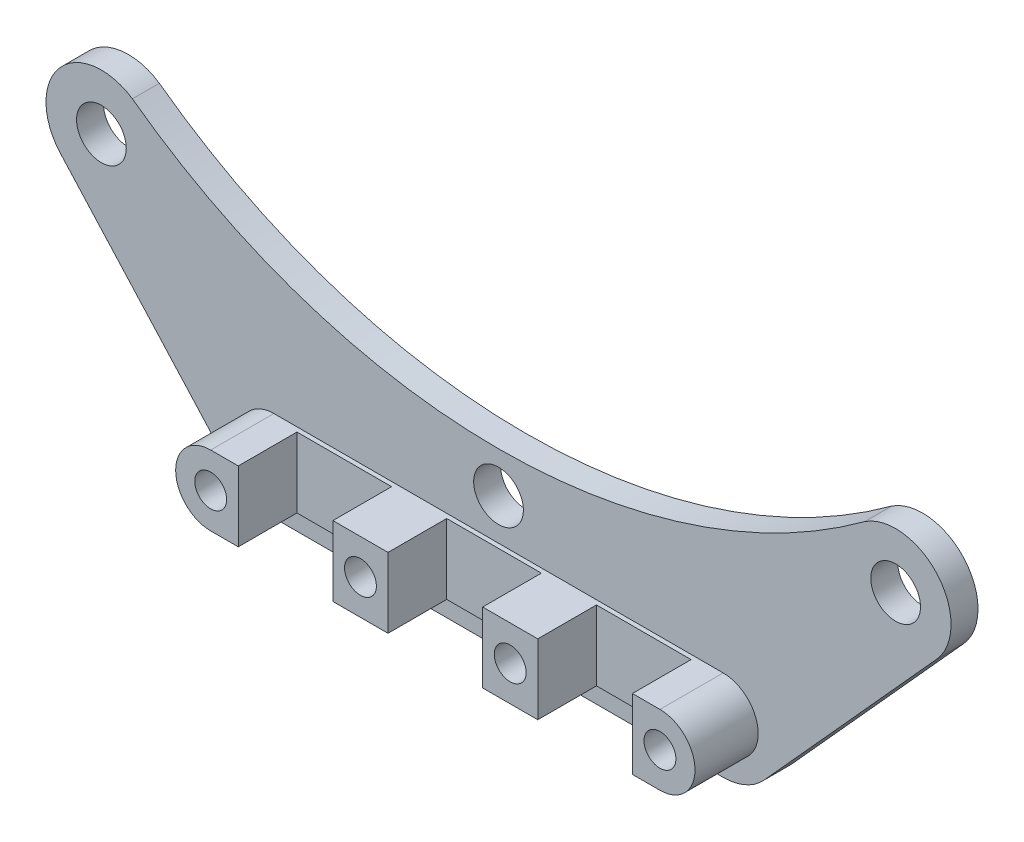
ISO-10303-21;
HEADER;
FILE_DESCRIPTION(('STEP AP214'),'2;1');
FILE_NAME('part.step','',(''),(''),'','','');
FILE_SCHEMA(('AUTOMOTIVE_DESIGN { 1 0 10303 214 1 1 1 1 }'));
ENDSEC;
DATA;
#1=APPLICATION_CONTEXT('core data for automotive mechanical design processes');
#2=APPLICATION_PROTOCOL_DEFINITION('international standard','automotive_design',2000,#1);
#3=PRODUCT_CONTEXT('',#1,'mechanical');
#4=PRODUCT('Part','Part','',(#3));
#5=PRODUCT_RELATED_PRODUCT_CATEGORY('part','',(#4));
#6=PRODUCT_DEFINITION_FORMATION('','',#4);
#7=PRODUCT_DEFINITION_CONTEXT('part definition',#1,'design');
#8=PRODUCT_DEFINITION('design','',#6,#7);
#9=PRODUCT_DEFINITION_SHAPE('','',#8);
#10=(LENGTH_UNIT() NAMED_UNIT(*) SI_UNIT(.MILLI.,.METRE.));
#11=(NAMED_UNIT(*) PLANE_ANGLE_UNIT() SI_UNIT($,.RADIAN.));
#12=(NAMED_UNIT(*) SI_UNIT($,.STERADIAN.) SOLID_ANGLE_UNIT());
#13=UNCERTAINTY_MEASURE_WITH_UNIT(LENGTH_MEASURE(1.E-05),#10,'distance_accuracy_value','');
#14=(GEOMETRIC_REPRESENTATION_CONTEXT(3) GLOBAL_UNCERTAINTY_ASSIGNED_CONTEXT((#13)) GLOBAL_UNIT_ASSIGNED_CONTEXT((#10,
#11,#12)) REPRESENTATION_CONTEXT('',''));
#15=CARTESIAN_POINT('',(0.,0.,0.));
#16=DIRECTION('',(0.,0.,1.));
#17=DIRECTION('',(1.,0.,0.));
#18=AXIS2_PLACEMENT_3D('',#15,#16,#17);
#19=CARTESIAN_POINT('',(0.,0.,7.6454));
#20=DIRECTION('',(0.,0.,1.));
#21=DIRECTION('',(1.,0.,0.));
#22=AXIS2_PLACEMENT_3D('',#19,#20,#21);
#23=PLANE('',#22);
#24=DIRECTION('',(0.,-1.,0.));
#25=VECTOR('',#24,1.);
#26=CARTESIAN_POINT('',(251.174680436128,0.,7.6454));
#27=LINE('',#26,#25);
#28=CARTESIAN_POINT('',(251.174680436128,54.27368514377,7.6454));
#29=VERTEX_POINT('',#28);
#30=CARTESIAN_POINT('',(251.174680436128,48.33008514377,7.6454));
#31=VERTEX_POINT('',#30);
#32=EDGE_CURVE('E216',#29,#31,#27,.T.);
#33=ORIENTED_EDGE('',*,*,#32,.F.);
#34=DIRECTION('',(1.,0.,0.));
#35=VECTOR('',#34,1.);
#36=CARTESIAN_POINT('',(0.,54.27368514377,7.6454));
#37=LINE('',#36,#35);
#38=CARTESIAN_POINT('',(246.501080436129,54.27368514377,7.6454));
#39=VERTEX_POINT('',#38);
#40=EDGE_CURVE('E802',#39,#29,#37,.T.);
#41=ORIENTED_EDGE('',*,*,#40,.F.);
#42=DIRECTION('',(0.,1.,0.));
#43=VECTOR('',#42,1.);
#44=CARTESIAN_POINT('',(246.501080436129,0.,7.6454));
#45=LINE('',#44,#43);
#46=CARTESIAN_POINT('',(246.501080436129,48.33008514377,7.6454));
#47=VERTEX_POINT('',#46);
#48=EDGE_CURVE('E240',#47,#39,#45,.T.);
#49=ORIENTED_EDGE('',*,*,#48,.F.);
#50=DIRECTION('',(-1.,0.,0.));
#51=VECTOR('',#50,1.);
#52=CARTESIAN_POINT('',(0.,48.3300851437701,7.6454));
#53=LINE('',#52,#51);
#54=EDGE_CURVE('E314',#31,#47,#53,.T.);
#55=ORIENTED_EDGE('',*,*,#54,.F.);
#56=EDGE_LOOP('',(#33,#41,#49,#55));
#57=FACE_BOUND('',#56,.T.);
#58=CARTESIAN_POINT('',(248.837880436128,51.30188514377,7.6454));
#59=DIRECTION('',(0.,0.,-1.));
#60=DIRECTION('',(-1.,0.,0.));
#61=AXIS2_PLACEMENT_3D('',#58,#59,#60);
#62=CIRCLE('',#61,1.35254999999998);
#63=CARTESIAN_POINT('',(247.485330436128,51.30188514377,7.6454));
#64=VERTEX_POINT('',#63);
#65=EDGE_CURVE('E287',#64,#64,#62,.T.);
#66=ORIENTED_EDGE('',*,*,#65,.T.);
#67=EDGE_LOOP('',(#66));
#68=FACE_BOUND('',#67,.T.);
#69=ADVANCED_FACE('F37',(#57,#68),#23,.T.);
#70=DIRECTION('',(0.,-1.,0.));
#71=VECTOR('',#70,1.);
#72=CARTESIAN_POINT('',(238.474680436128,0.,7.6454));
#73=LINE('',#72,#71);
#74=CARTESIAN_POINT('',(238.474680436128,54.27368514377,7.6454));
#75=VERTEX_POINT('',#74);
#76=CARTESIAN_POINT('',(238.474680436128,48.33008514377,7.6454));
#77=VERTEX_POINT('',#76);
#78=EDGE_CURVE('E232',#75,#77,#73,.T.);
#79=ORIENTED_EDGE('',*,*,#78,.F.);
#80=CARTESIAN_POINT('',(233.801080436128,54.27368514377,7.6454));
#81=VERTEX_POINT('',#80);
#82=EDGE_CURVE('E307',#81,#75,#37,.T.);
#83=ORIENTED_EDGE('',*,*,#82,.F.);
#84=DIRECTION('',(0.,1.,0.));
#85=VECTOR('',#84,1.);
#86=CARTESIAN_POINT('',(233.801080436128,0.,7.6454));
#87=LINE('',#86,#85);
#88=CARTESIAN_POINT('',(233.801080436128,48.33008514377,7.6454));
#89=VERTEX_POINT('',#88);
#90=EDGE_CURVE('E266',#89,#81,#87,.T.);
#91=ORIENTED_EDGE('',*,*,#90,.F.);
#92=EDGE_CURVE('E789',#77,#89,#53,.T.);
#93=ORIENTED_EDGE('',*,*,#92,.F.);
#94=EDGE_LOOP('',(#79,#83,#91,#93));
#95=FACE_BOUND('',#94,.T.);
#96=CARTESIAN_POINT('',(236.137880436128,51.30188514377,7.6454));
#97=DIRECTION('',(0.,0.,-1.));
#98=DIRECTION('',(-1.,0.,0.));
#99=AXIS2_PLACEMENT_3D('',#96,#97,#98);
#100=CIRCLE('',#99,1.35255000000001);
#101=CARTESIAN_POINT('',(234.785330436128,51.30188514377,7.6454));
#102=VERTEX_POINT('',#101);
#103=EDGE_CURVE('E293',#102,#102,#100,.T.);
#104=ORIENTED_EDGE('',*,*,#103,.T.);
#105=EDGE_LOOP('',(#104));
#106=FACE_BOUND('',#105,.T.);
#107=ADVANCED_FACE('F460',(#95,#106),#23,.T.);
#108=DIRECTION('',(0.,-1.,0.));
#109=VECTOR('',#108,1.);
#110=CARTESIAN_POINT('',(225.774680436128,0.,7.6454));
#111=LINE('',#110,#109);
#112=CARTESIAN_POINT('',(225.774680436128,54.27368514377,7.6454));
#113=VERTEX_POINT('',#112);
#114=CARTESIAN_POINT('',(225.774680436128,48.33008514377,7.6454));
#115=VERTEX_POINT('',#114);
#116=EDGE_CURVE('E258',#113,#115,#111,.T.);
#117=ORIENTED_EDGE('',*,*,#116,.F.);
#118=CARTESIAN_POINT('',(223.437880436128,54.27368514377,7.6454));
#119=VERTEX_POINT('',#118);
#120=EDGE_CURVE('E303',#119,#113,#37,.T.);
#121=ORIENTED_EDGE('',*,*,#120,.F.);
#122=CARTESIAN_POINT('',(223.437880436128,51.30188514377,7.6454));
#123=DIRECTION('',(0.,0.,1.));
#124=DIRECTION('',(1.,0.,0.));
#125=AXIS2_PLACEMENT_3D('',#122,#123,#124);
#126=CIRCLE('',#125,2.97179999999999);
#127=CARTESIAN_POINT('',(223.437880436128,48.33008514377,7.6454));
#128=VERTEX_POINT('',#127);
#129=EDGE_CURVE('E306',#119,#128,#126,.T.);
#130=ORIENTED_EDGE('',*,*,#129,.T.);
#131=EDGE_CURVE('E311',#115,#128,#53,.T.);
#132=ORIENTED_EDGE('',*,*,#131,.F.);
#133=EDGE_LOOP('',(#117,#121,#130,#132));
#134=FACE_BOUND('',#133,.T.);
#135=CARTESIAN_POINT('',(223.437880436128,51.30188514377,7.6454));
#136=DIRECTION('',(0.,0.,-1.));
#137=DIRECTION('',(-1.,0.,0.));
#138=AXIS2_PLACEMENT_3D('',#135,#136,#137);
#139=CIRCLE('',#138,1.35255000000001);
#140=CARTESIAN_POINT('',(222.085330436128,51.30188514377,7.6454));
#141=VERTEX_POINT('',#140);
#142=EDGE_CURVE('E299',#141,#141,#139,.T.);
#143=ORIENTED_EDGE('',*,*,#142,.T.);
#144=EDGE_LOOP('',(#143));
#145=FACE_BOUND('',#144,.T.);
#146=ADVANCED_FACE('F467',(#134,#145),#23,.T.);
#147=CARTESIAN_POINT('',(0.,0.,2.286));
#148=DIRECTION('',(0.,0.,1.));
#149=DIRECTION('',(1.,0.,0.));
#150=AXIS2_PLACEMENT_3D('',#147,#148,#149);
#151=PLANE('',#150);
#152=CARTESIAN_POINT('',(242.487880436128,57.75348514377,2.286));
#153=DIRECTION('',(0.,0.,1.));
#154=DIRECTION('',(1.,0.,0.));
#155=AXIS2_PLACEMENT_3D('',#152,#153,#154);
#156=CIRCLE('',#155,2.1082);
#157=CARTESIAN_POINT('',(244.596080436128,57.75348514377,2.286));
#158=VERTEX_POINT('',#157);
#159=EDGE_CURVE('E339',#158,#158,#156,.T.);
#160=ORIENTED_EDGE('',*,*,#159,.F.);
#161=EDGE_LOOP('',(#160));
#162=FACE_BOUND('',#161,.T.);
#163=CARTESIAN_POINT('',(276.167366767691,67.4916222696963,2.286));
#164=DIRECTION('',(0.,0.,1.));
#165=DIRECTION('',(1.,0.,0.));
#166=AXIS2_PLACEMENT_3D('',#163,#164,#165);
#167=CIRCLE('',#166,2.1082);
#168=CARTESIAN_POINT('',(278.275566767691,67.4916222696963,2.286));
#169=VERTEX_POINT('',#168);
#170=EDGE_CURVE('E342',#169,#169,#167,.T.);
#171=ORIENTED_EDGE('',*,*,#170,.F.);
#172=EDGE_LOOP('',(#171));
#173=FACE_BOUND('',#172,.T.);
#174=CARTESIAN_POINT('',(208.808394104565,67.4916222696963,2.286));
#175=DIRECTION('',(0.,0.,1.));
#176=DIRECTION('',(1.,0.,0.));
#177=AXIS2_PLACEMENT_3D('',#174,#175,#176);
#178=CIRCLE('',#177,2.10819999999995);
#179=CARTESIAN_POINT('',(210.916594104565,67.4916222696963,2.286));
#180=VERTEX_POINT('',#179);
#181=EDGE_CURVE('E346',#180,#180,#178,.T.);
#182=ORIENTED_EDGE('',*,*,#181,.F.);
#183=EDGE_LOOP('',(#182));
#184=FACE_BOUND('',#183,.T.);
#185=DIRECTION('',(-0.670450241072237,-0.741954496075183,0.));
#186=VECTOR('',#185,1.);
#187=CARTESIAN_POINT('',(121.942332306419,-110.190404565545,2.286));
#188=LINE('',#187,#186);
#189=CARTESIAN_POINT('',(279.653810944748,64.3411765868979,2.286));
#190=VERTEX_POINT('',#189);
#191=CARTESIAN_POINT('',(265.024324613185,48.1514394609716,2.286));
#192=VERTEX_POINT('',#191);
#193=EDGE_CURVE('E349',#190,#192,#188,.T.);
#194=ORIENTED_EDGE('',*,*,#193,.F.);
#195=CARTESIAN_POINT('',(276.167366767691,67.4916222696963,2.286));
#196=DIRECTION('',(0.,0.,1.));
#197=DIRECTION('',(1.,0.,0.));
#198=AXIS2_PLACEMENT_3D('',#195,#196,#197);
#199=CIRCLE('',#198,4.69899999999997);
#200=CARTESIAN_POINT('',(273.539963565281,71.3874345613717,2.286));
#201=VERTEX_POINT('',#200);
#202=EDGE_CURVE('E352',#190,#201,#199,.T.);
#203=ORIENTED_EDGE('',*,*,#202,.T.);
#204=CARTESIAN_POINT('',(242.487880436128,113.65888514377,2.286));
#205=DIRECTION('',(0.,0.,1.));
#206=DIRECTION('',(1.,0.,0.));
#207=AXIS2_PLACEMENT_3D('',#204,#205,#206);
#208=CIRCLE('',#207,52.451);
#209=CARTESIAN_POINT('',(211.435797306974,71.3874345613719,2.286));
#210=VERTEX_POINT('',#209);
#211=EDGE_CURVE('E354',#210,#201,#208,.T.);
#212=ORIENTED_EDGE('',*,*,#211,.F.);
#213=CARTESIAN_POINT('',(208.808394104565,67.4916222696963,2.286));
#214=DIRECTION('',(0.,0.,1.));
#215=DIRECTION('',(1.,0.,0.));
#216=AXIS2_PLACEMENT_3D('',#213,#214,#215);
#217=CIRCLE('',#216,4.699);
#218=CARTESIAN_POINT('',(205.321949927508,64.3411765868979,2.286));
#219=VERTEX_POINT('',#218);
#220=EDGE_CURVE('E357',#210,#219,#217,.T.);
#221=ORIENTED_EDGE('',*,*,#220,.T.);
#222=DIRECTION('',(0.670450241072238,-0.741954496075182,0.));
#223=VECTOR('',#222,1.);
#224=CARTESIAN_POINT('',(145.035114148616,131.057669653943,2.286));
#225=LINE('',#224,#223);
#226=CARTESIAN_POINT('',(219.951436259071,48.1514394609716,2.286));
#227=VERTEX_POINT('',#226);
#228=EDGE_CURVE('E360',#219,#227,#225,.T.);
#229=ORIENTED_EDGE('',*,*,#228,.T.);
#230=CARTESIAN_POINT('',(223.437880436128,51.30188514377,2.286));
#231=DIRECTION('',(0.,0.,1.));
#232=DIRECTION('',(1.,0.,0.));
#233=AXIS2_PLACEMENT_3D('',#230,#231,#232);
#234=CIRCLE('',#233,4.69899999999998);
#235=CARTESIAN_POINT('',(223.437880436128,46.6028851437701,2.286));
#236=VERTEX_POINT('',#235);
#237=EDGE_CURVE('E363',#227,#236,#234,.T.);
#238=ORIENTED_EDGE('',*,*,#237,.T.);
#239=DIRECTION('',(-1.,0.,0.));
#240=VECTOR('',#239,1.);
#241=CARTESIAN_POINT('',(0.,46.6028851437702,2.286));
#242=LINE('',#241,#240);
#243=CARTESIAN_POINT('',(261.537880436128,46.60288514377,2.286));
#244=VERTEX_POINT('',#243);
#245=EDGE_CURVE('E365',#244,#236,#242,.T.);
#246=ORIENTED_EDGE('',*,*,#245,.F.);
#247=CARTESIAN_POINT('',(261.537880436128,51.30188514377,2.286));
#248=DIRECTION('',(0.,0.,1.));
#249=DIRECTION('',(1.,0.,0.));
#250=AXIS2_PLACEMENT_3D('',#247,#248,#249);
#251=CIRCLE('',#250,4.69899999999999);
#252=EDGE_CURVE('E368',#244,#192,#251,.T.);
#253=ORIENTED_EDGE('',*,*,#252,.T.);
#254=EDGE_LOOP('',(#194,#203,#212,#221,#229,#238,#246,#253));
#255=FACE_BOUND('',#254,.T.);
#256=CARTESIAN_POINT('',(223.437880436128,51.30188514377,2.286));
#257=DIRECTION('',(0.,0.,1.));
#258=DIRECTION('',(1.,0.,0.));
#259=AXIS2_PLACEMENT_3D('',#256,#257,#258);
#260=CIRCLE('',#259,2.97179999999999);
#261=CARTESIAN_POINT('',(223.437880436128,54.27368514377,2.286));
#262=VERTEX_POINT('',#261);
#263=CARTESIAN_POINT('',(223.437880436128,48.33008514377,2.286));
#264=VERTEX_POINT('',#263);
#265=EDGE_CURVE('E319',#262,#264,#260,.T.);
#266=ORIENTED_EDGE('',*,*,#265,.F.);
#267=DIRECTION('',(1.,0.,0.));
#268=VECTOR('',#267,1.);
#269=CARTESIAN_POINT('',(0.,54.27368514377,2.286));
#270=LINE('',#269,#268);
#271=CARTESIAN_POINT('',(261.537880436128,54.27368514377,2.286));
#272=VERTEX_POINT('',#271);
#273=EDGE_CURVE('E302',#262,#272,#270,.T.);
#274=ORIENTED_EDGE('',*,*,#273,.T.);
#275=CARTESIAN_POINT('',(261.537880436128,51.30188514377,2.286));
#276=DIRECTION('',(0.,0.,1.));
#277=DIRECTION('',(1.,0.,0.));
#278=AXIS2_PLACEMENT_3D('',#275,#276,#277);
#279=CIRCLE('',#278,2.9718);
#280=CARTESIAN_POINT('',(261.537880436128,48.33008514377,2.286));
#281=VERTEX_POINT('',#280);
#282=EDGE_CURVE('E324',#281,#272,#279,.T.);
#283=ORIENTED_EDGE('',*,*,#282,.F.);
#284=DIRECTION('',(-1.,0.,0.));
#285=VECTOR('',#284,1.);
#286=CARTESIAN_POINT('',(0.,48.3300851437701,2.286));
#287=LINE('',#286,#285);
#288=EDGE_CURVE('E322',#281,#264,#287,.T.);
#289=ORIENTED_EDGE('',*,*,#288,.T.);
#290=EDGE_LOOP('',(#266,#274,#283,#289));
#291=FACE_BOUND('',#290,.T.);
#292=ADVANCED_FACE('F433',(#162,#173,#184,#255,#291),#151,.T.);
#293=CARTESIAN_POINT('',(121.942332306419,-110.190404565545,2.286));
#294=DIRECTION('',(0.741954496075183,-0.670450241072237,0.));
#295=DIRECTION('',(0.670450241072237,0.741954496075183,0.));
#296=AXIS2_PLACEMENT_3D('',#293,#294,#295);
#297=PLANE('',#296);
#298=DIRECTION('',(-0.670450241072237,-0.741954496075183,0.));
#299=VECTOR('',#298,1.);
#300=CARTESIAN_POINT('',(121.942332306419,-110.190404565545,0.));
#301=LINE('',#300,#299);
#302=CARTESIAN_POINT('',(279.653810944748,64.3411765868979,0.));
#303=VERTEX_POINT('',#302);
#304=CARTESIAN_POINT('',(265.024324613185,48.1514394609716,0.));
#305=VERTEX_POINT('',#304);
#306=EDGE_CURVE('E379',#303,#305,#301,.T.);
#307=ORIENTED_EDGE('',*,*,#306,.F.);
#308=DIRECTION('',(0.,0.,-1.));
#309=VECTOR('',#308,1.);
#310=CARTESIAN_POINT('',(279.653810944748,64.3411765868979,2.286));
#311=LINE('',#310,#309);
#312=EDGE_CURVE('E11',#190,#303,#311,.T.);
#313=ORIENTED_EDGE('',*,*,#312,.F.);
#314=ORIENTED_EDGE('',*,*,#193,.T.);
#315=DIRECTION('',(0.,0.,-1.));
#316=VECTOR('',#315,1.);
#317=CARTESIAN_POINT('',(265.024324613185,48.1514394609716,2.286));
#318=LINE('',#317,#316);
#319=EDGE_CURVE('E370',#192,#305,#318,.T.);
#320=ORIENTED_EDGE('',*,*,#319,.T.);
#321=EDGE_LOOP('',(#307,#313,#314,#320));
#322=FACE_BOUND('',#321,.T.);
#323=ADVANCED_FACE('F439',(#322),#297,.T.);
#324=CARTESIAN_POINT('',(276.167366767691,67.4916222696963,2.286));
#325=DIRECTION('',(0.,0.,-1.));
#326=DIRECTION('',(-1.,0.,0.));
#327=AXIS2_PLACEMENT_3D('',#324,#325,#326);
#328=CYLINDRICAL_SURFACE('',#327,4.69899999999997);
#329=CARTESIAN_POINT('',(276.167366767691,67.4916222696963,0.));
#330=DIRECTION('',(0.,0.,1.));
#331=DIRECTION('',(1.,0.,0.));
#332=AXIS2_PLACEMENT_3D('',#329,#330,#331);
#333=CIRCLE('',#332,4.69899999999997);
#334=CARTESIAN_POINT('',(273.539963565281,71.3874345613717,0.));
#335=VERTEX_POINT('',#334);
#336=EDGE_CURVE('E382',#303,#335,#333,.T.);
#337=ORIENTED_EDGE('',*,*,#336,.T.);
#338=DIRECTION('',(0.,0.,-1.));
#339=VECTOR('',#338,1.);
#340=CARTESIAN_POINT('',(273.539963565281,71.3874345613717,2.286));
#341=LINE('',#340,#339);
#342=EDGE_CURVE('E45',#201,#335,#341,.T.);
#343=ORIENTED_EDGE('',*,*,#342,.F.);
#344=ORIENTED_EDGE('',*,*,#202,.F.);
#345=ORIENTED_EDGE('',*,*,#312,.T.);
#346=EDGE_LOOP('',(#337,#343,#344,#345));
#347=FACE_BOUND('',#346,.T.);
#348=ADVANCED_FACE('F422',(#347),#328,.T.);
#349=CARTESIAN_POINT('',(242.487880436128,113.65888514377,2.286));
#350=DIRECTION('',(0.,0.,-1.));
#351=DIRECTION('',(-1.,0.,0.));
#352=AXIS2_PLACEMENT_3D('',#349,#350,#351);
#353=CYLINDRICAL_SURFACE('',#352,52.451);
#354=CARTESIAN_POINT('',(242.487880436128,113.65888514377,0.));
#355=DIRECTION('',(0.,0.,1.));
#356=DIRECTION('',(1.,0.,0.));
#357=AXIS2_PLACEMENT_3D('',#354,#355,#356);
#358=CIRCLE('',#357,52.451);
#359=CARTESIAN_POINT('',(211.435797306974,71.3874345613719,0.));
#360=VERTEX_POINT('',#359);
#361=EDGE_CURVE('E385',#360,#335,#358,.T.);
#362=ORIENTED_EDGE('',*,*,#361,.F.);
#363=DIRECTION('',(0.,0.,-1.));
#364=VECTOR('',#363,1.);
#365=CARTESIAN_POINT('',(211.435797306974,71.3874345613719,2.286));
#366=LINE('',#365,#364);
#367=EDGE_CURVE('E413',#210,#360,#366,.T.);
#368=ORIENTED_EDGE('',*,*,#367,.F.);
#369=ORIENTED_EDGE('',*,*,#211,.T.);
#370=ORIENTED_EDGE('',*,*,#342,.T.);
#371=EDGE_LOOP('',(#362,#368,#369,#370));
#372=FACE_BOUND('',#371,.T.);
#373=ADVANCED_FACE('F417',(#372),#353,.F.);
#374=CARTESIAN_POINT('',(208.808394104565,67.4916222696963,2.286));
#375=DIRECTION('',(0.,0.,-1.));
#376=DIRECTION('',(-1.,0.,0.));
#377=AXIS2_PLACEMENT_3D('',#374,#375,#376);
#378=CYLINDRICAL_SURFACE('',#377,4.699);
#379=CARTESIAN_POINT('',(208.808394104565,67.4916222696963,0.));
#380=DIRECTION('',(0.,0.,1.));
#381=DIRECTION('',(1.,0.,0.));
#382=AXIS2_PLACEMENT_3D('',#379,#380,#381);
#383=CIRCLE('',#382,4.699);
#384=CARTESIAN_POINT('',(205.321949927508,64.3411765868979,0.));
#385=VERTEX_POINT('',#384);
#386=EDGE_CURVE('E388',#360,#385,#383,.T.);
#387=ORIENTED_EDGE('',*,*,#386,.T.);
#388=DIRECTION('',(0.,0.,-1.));
#389=VECTOR('',#388,1.);
#390=CARTESIAN_POINT('',(205.321949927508,64.3411765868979,2.286));
#391=LINE('',#390,#389);
#392=EDGE_CURVE('E410',#219,#385,#391,.T.);
#393=ORIENTED_EDGE('',*,*,#392,.F.);
#394=ORIENTED_EDGE('',*,*,#220,.F.);
#395=ORIENTED_EDGE('',*,*,#367,.T.);
#396=EDGE_LOOP('',(#387,#393,#394,#395));
#397=FACE_BOUND('',#396,.T.);
#398=ADVANCED_FACE('F429',(#397),#378,.T.);
#399=CARTESIAN_POINT('',(145.035114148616,131.057669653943,2.286));
#400=DIRECTION('',(0.741954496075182,0.670450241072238,0.));
#401=DIRECTION('',(-0.670450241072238,0.741954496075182,0.));
#402=AXIS2_PLACEMENT_3D('',#399,#400,#401);
#403=PLANE('',#402);
#404=DIRECTION('',(0.670450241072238,-0.741954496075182,0.));
#405=VECTOR('',#404,1.);
#406=CARTESIAN_POINT('',(145.035114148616,131.057669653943,0.));
#407=LINE('',#406,#405);
#408=CARTESIAN_POINT('',(219.951436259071,48.1514394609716,0.));
#409=VERTEX_POINT('',#408);
#410=EDGE_CURVE('E391',#385,#409,#407,.T.);
#411=ORIENTED_EDGE('',*,*,#410,.T.);
#412=DIRECTION('',(0.,0.,-1.));
#413=VECTOR('',#412,1.);
#414=CARTESIAN_POINT('',(219.951436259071,48.1514394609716,2.286));
#415=LINE('',#414,#413);
#416=EDGE_CURVE('E407',#227,#409,#415,.T.);
#417=ORIENTED_EDGE('',*,*,#416,.F.);
#418=ORIENTED_EDGE('',*,*,#228,.F.);
#419=ORIENTED_EDGE('',*,*,#392,.T.);
#420=EDGE_LOOP('',(#411,#417,#418,#419));
#421=FACE_BOUND('',#420,.T.);
#422=ADVANCED_FACE('F450',(#421),#403,.F.);
#423=CARTESIAN_POINT('',(223.437880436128,51.30188514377,2.286));
#424=DIRECTION('',(0.,0.,-1.));
#425=DIRECTION('',(-1.,0.,0.));
#426=AXIS2_PLACEMENT_3D('',#423,#424,#425);
#427=CYLINDRICAL_SURFACE('',#426,4.69899999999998);
#428=CARTESIAN_POINT('',(223.437880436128,51.30188514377,0.));
#429=DIRECTION('',(0.,0.,1.));
#430=DIRECTION('',(1.,0.,0.));
#431=AXIS2_PLACEMENT_3D('',#428,#429,#430);
#432=CIRCLE('',#431,4.69899999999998);
#433=CARTESIAN_POINT('',(223.437880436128,46.6028851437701,0.));
#434=VERTEX_POINT('',#433);
#435=EDGE_CURVE('E394',#409,#434,#432,.T.);
#436=ORIENTED_EDGE('',*,*,#435,.T.);
#437=DIRECTION('',(0.,0.,-1.));
#438=VECTOR('',#437,1.);
#439=CARTESIAN_POINT('',(223.437880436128,46.6028851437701,2.286));
#440=LINE('',#439,#438);
#441=EDGE_CURVE('E405',#236,#434,#440,.T.);
#442=ORIENTED_EDGE('',*,*,#441,.F.);
#443=ORIENTED_EDGE('',*,*,#237,.F.);
#444=ORIENTED_EDGE('',*,*,#416,.T.);
#445=EDGE_LOOP('',(#436,#442,#443,#444));
#446=FACE_BOUND('',#445,.T.);
#447=ADVANCED_FACE('F447',(#446),#427,.T.);
#448=CARTESIAN_POINT('',(0.,46.6028851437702,2.286));
#449=DIRECTION('',(0.,-1.,0.));
#450=DIRECTION('',(1.,0.,0.));
#451=AXIS2_PLACEMENT_3D('',#448,#449,#450);
#452=PLANE('',#451);
#453=DIRECTION('',(-1.,0.,0.));
#454=VECTOR('',#453,1.);
#455=CARTESIAN_POINT('',(0.,46.6028851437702,0.));
#456=LINE('',#455,#454);
#457=CARTESIAN_POINT('',(261.537880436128,46.60288514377,0.));
#458=VERTEX_POINT('',#457);
#459=EDGE_CURVE('E397',#458,#434,#456,.T.);
#460=ORIENTED_EDGE('',*,*,#459,.F.);
#461=DIRECTION('',(0.,0.,-1.));
#462=VECTOR('',#461,1.);
#463=CARTESIAN_POINT('',(261.537880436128,46.60288514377,2.286));
#464=LINE('',#463,#462);
#465=EDGE_CURVE('E403',#244,#458,#464,.T.);
#466=ORIENTED_EDGE('',*,*,#465,.F.);
#467=ORIENTED_EDGE('',*,*,#245,.T.);
#468=ORIENTED_EDGE('',*,*,#441,.T.);
#469=EDGE_LOOP('',(#460,#466,#467,#468));
#470=FACE_BOUND('',#469,.T.);
#471=ADVANCED_FACE('F444',(#470),#452,.T.);
#472=CARTESIAN_POINT('',(208.808394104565,67.4916222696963,2.286));
#473=DIRECTION('',(0.,0.,-1.));
#474=DIRECTION('',(-1.,0.,0.));
#475=AXIS2_PLACEMENT_3D('',#472,#473,#474);
#476=CYLINDRICAL_SURFACE('',#475,2.10819999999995);
#477=ORIENTED_EDGE('',*,*,#181,.T.);
#478=EDGE_LOOP('',(#477));
#479=FACE_BOUND('',#478,.T.);
#480=CARTESIAN_POINT('',(208.808394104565,67.4916222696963,0.));
#481=DIRECTION('',(0.,0.,1.));
#482=DIRECTION('',(1.,0.,0.));
#483=AXIS2_PLACEMENT_3D('',#480,#481,#482);
#484=CIRCLE('',#483,2.10819999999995);
#485=CARTESIAN_POINT('',(210.916594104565,67.4916222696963,0.));
#486=VERTEX_POINT('',#485);
#487=EDGE_CURVE('E376',#486,#486,#484,.T.);
#488=ORIENTED_EDGE('',*,*,#487,.F.);
#489=EDGE_LOOP('',(#488));
#490=FACE_BOUND('',#489,.T.);
#491=ADVANCED_FACE('F512',(#479,#490),#476,.F.);
#492=CARTESIAN_POINT('',(276.167366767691,67.4916222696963,2.286));
#493=DIRECTION('',(0.,0.,-1.));
#494=DIRECTION('',(-1.,0.,0.));
#495=AXIS2_PLACEMENT_3D('',#492,#493,#494);
#496=CYLINDRICAL_SURFACE('',#495,2.1082);
#497=ORIENTED_EDGE('',*,*,#170,.T.);
#498=EDGE_LOOP('',(#497));
#499=FACE_BOUND('',#498,.T.);
#500=CARTESIAN_POINT('',(276.167366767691,67.4916222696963,0.));
#501=DIRECTION('',(0.,0.,1.));
#502=DIRECTION('',(1.,0.,0.));
#503=AXIS2_PLACEMENT_3D('',#500,#501,#502);
#504=CIRCLE('',#503,2.1082);
#505=CARTESIAN_POINT('',(278.275566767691,67.4916222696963,0.));
#506=VERTEX_POINT('',#505);
#507=EDGE_CURVE('E373',#506,#506,#504,.T.);
#508=ORIENTED_EDGE('',*,*,#507,.F.);
#509=EDGE_LOOP('',(#508));
#510=FACE_BOUND('',#509,.T.);
#511=ADVANCED_FACE('F514',(#499,#510),#496,.F.);
#512=CARTESIAN_POINT('',(242.487880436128,57.75348514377,2.286));
#513=DIRECTION('',(0.,0.,-1.));
#514=DIRECTION('',(-1.,0.,0.));
#515=AXIS2_PLACEMENT_3D('',#512,#513,#514);
#516=CYLINDRICAL_SURFACE('',#515,2.1082);
#517=ORIENTED_EDGE('',*,*,#159,.T.);
#518=EDGE_LOOP('',(#517));
#519=FACE_BOUND('',#518,.T.);
#520=CARTESIAN_POINT('',(242.487880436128,57.75348514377,0.));
#521=DIRECTION('',(0.,0.,1.));
#522=DIRECTION('',(1.,0.,0.));
#523=AXIS2_PLACEMENT_3D('',#520,#521,#522);
#524=CIRCLE('',#523,2.1082);
#525=CARTESIAN_POINT('',(244.596080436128,57.75348514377,0.));
#526=VERTEX_POINT('',#525);
#527=EDGE_CURVE('E338',#526,#526,#524,.T.);
#528=ORIENTED_EDGE('',*,*,#527,.F.);
#529=EDGE_LOOP('',(#528));
#530=FACE_BOUND('',#529,.T.);
#531=ADVANCED_FACE('F39',(#519,#530),#516,.F.);
#532=CARTESIAN_POINT('',(261.537880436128,51.30188514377,2.286));
#533=DIRECTION('',(0.,0.,-1.));
#534=DIRECTION('',(-1.,0.,0.));
#535=AXIS2_PLACEMENT_3D('',#532,#533,#534);
#536=CYLINDRICAL_SURFACE('',#535,4.69899999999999);
#537=CARTESIAN_POINT('',(261.537880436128,51.30188514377,0.));
#538=DIRECTION('',(0.,0.,1.));
#539=DIRECTION('',(1.,0.,0.));
#540=AXIS2_PLACEMENT_3D('',#537,#538,#539);
#541=CIRCLE('',#540,4.69899999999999);
#542=EDGE_CURVE('E343',#458,#305,#541,.T.);
#543=ORIENTED_EDGE('',*,*,#542,.T.);
#544=ORIENTED_EDGE('',*,*,#319,.F.);
#545=ORIENTED_EDGE('',*,*,#252,.F.);
#546=ORIENTED_EDGE('',*,*,#465,.T.);
#547=EDGE_LOOP('',(#543,#544,#545,#546));
#548=FACE_BOUND('',#547,.T.);
#549=ADVANCED_FACE('F503',(#548),#536,.T.);
#550=CARTESIAN_POINT('',(0.,0.,0.));
#551=DIRECTION('',(0.,0.,1.));
#552=DIRECTION('',(1.,0.,0.));
#553=AXIS2_PLACEMENT_3D('',#550,#551,#552);
#554=PLANE('',#553);
#555=CARTESIAN_POINT('',(261.537880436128,51.30188514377,0.));
#556=DIRECTION('',(0.,0.,-1.));
#557=DIRECTION('',(-1.,0.,0.));
#558=AXIS2_PLACEMENT_3D('',#555,#556,#557);
#559=CIRCLE('',#558,1.35255000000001);
#560=CARTESIAN_POINT('',(260.185330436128,51.30188514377,0.));
#561=VERTEX_POINT('',#560);
#562=EDGE_CURVE('E277',#561,#561,#559,.T.);
#563=ORIENTED_EDGE('',*,*,#562,.F.);
#564=EDGE_LOOP('',(#563));
#565=FACE_BOUND('',#564,.T.);
#566=CARTESIAN_POINT('',(248.837880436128,51.30188514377,0.));
#567=DIRECTION('',(0.,0.,-1.));
#568=DIRECTION('',(-1.,0.,0.));
#569=AXIS2_PLACEMENT_3D('',#566,#567,#568);
#570=CIRCLE('',#569,1.35254999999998);
#571=CARTESIAN_POINT('',(247.485330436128,51.30188514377,0.));
#572=VERTEX_POINT('',#571);
#573=EDGE_CURVE('E284',#572,#572,#570,.T.);
#574=ORIENTED_EDGE('',*,*,#573,.F.);
#575=EDGE_LOOP('',(#574));
#576=FACE_BOUND('',#575,.T.);
#577=CARTESIAN_POINT('',(236.137880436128,51.30188514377,0.));
#578=DIRECTION('',(0.,0.,-1.));
#579=DIRECTION('',(-1.,0.,0.));
#580=AXIS2_PLACEMENT_3D('',#577,#578,#579);
#581=CIRCLE('',#580,1.35255000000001);
#582=CARTESIAN_POINT('',(234.785330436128,51.30188514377,0.));
#583=VERTEX_POINT('',#582);
#584=EDGE_CURVE('E290',#583,#583,#581,.T.);
#585=ORIENTED_EDGE('',*,*,#584,.F.);
#586=EDGE_LOOP('',(#585));
#587=FACE_BOUND('',#586,.T.);
#588=CARTESIAN_POINT('',(223.437880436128,51.30188514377,0.));
#589=DIRECTION('',(0.,0.,-1.));
#590=DIRECTION('',(-1.,0.,0.));
#591=AXIS2_PLACEMENT_3D('',#588,#589,#590);
#592=CIRCLE('',#591,1.35255000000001);
#593=CARTESIAN_POINT('',(222.085330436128,51.30188514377,0.));
#594=VERTEX_POINT('',#593);
#595=EDGE_CURVE('E296',#594,#594,#592,.T.);
#596=ORIENTED_EDGE('',*,*,#595,.F.);
#597=EDGE_LOOP('',(#596));
#598=FACE_BOUND('',#597,.T.);
#599=ORIENTED_EDGE('',*,*,#527,.T.);
#600=EDGE_LOOP('',(#599));
#601=FACE_BOUND('',#600,.T.);
#602=ORIENTED_EDGE('',*,*,#507,.T.);
#603=EDGE_LOOP('',(#602));
#604=FACE_BOUND('',#603,.T.);
#605=ORIENTED_EDGE('',*,*,#487,.T.);
#606=EDGE_LOOP('',(#605));
#607=FACE_BOUND('',#606,.T.);
#608=ORIENTED_EDGE('',*,*,#306,.T.);
#609=ORIENTED_EDGE('',*,*,#542,.F.);
#610=ORIENTED_EDGE('',*,*,#459,.T.);
#611=ORIENTED_EDGE('',*,*,#435,.F.);
#612=ORIENTED_EDGE('',*,*,#410,.F.);
#613=ORIENTED_EDGE('',*,*,#386,.F.);
#614=ORIENTED_EDGE('',*,*,#361,.T.);
#615=ORIENTED_EDGE('',*,*,#336,.F.);
#616=EDGE_LOOP('',(#608,#609,#610,#611,#612,#613,#614,#615));
#617=FACE_BOUND('',#616,.T.);
#618=ADVANCED_FACE('F426',(#565,#576,#587,#598,#601,#604,#607,#617),#554,.F.);
#619=CARTESIAN_POINT('',(0.,54.27368514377,7.6454));
#620=DIRECTION('',(0.,1.,0.));
#621=DIRECTION('',(-1.,0.,0.));
#622=AXIS2_PLACEMENT_3D('',#619,#620,#621);
#623=PLANE('',#622);
#624=DIRECTION('',(0.,0.,1.));
#625=VECTOR('',#624,1.);
#626=CARTESIAN_POINT('',(251.174680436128,54.27368514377,2.667));
#627=LINE('',#626,#625);
#628=CARTESIAN_POINT('',(251.174680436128,54.27368514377,2.667));
#629=VERTEX_POINT('',#628);
#630=EDGE_CURVE('E223',#629,#29,#627,.T.);
#631=ORIENTED_EDGE('',*,*,#630,.F.);
#632=DIRECTION('',(-1.,0.,0.));
#633=VECTOR('',#632,1.);
#634=CARTESIAN_POINT('',(0.,54.27368514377,2.667));
#635=LINE('',#634,#633);
#636=CARTESIAN_POINT('',(259.201080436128,54.27368514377,2.667));
#637=VERTEX_POINT('',#636);
#638=EDGE_CURVE('E206',#637,#629,#635,.T.);
#639=ORIENTED_EDGE('',*,*,#638,.F.);
#640=DIRECTION('',(0.,0.,1.));
#641=VECTOR('',#640,1.);
#642=CARTESIAN_POINT('',(259.201080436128,54.27368514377,2.667));
#643=LINE('',#642,#641);
#644=CARTESIAN_POINT('',(259.201080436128,54.27368514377,7.6454));
#645=VERTEX_POINT('',#644);
#646=EDGE_CURVE('E203',#637,#645,#643,.T.);
#647=ORIENTED_EDGE('',*,*,#646,.T.);
#648=CARTESIAN_POINT('',(261.537880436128,54.27368514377,7.6454));
#649=VERTEX_POINT('',#648);
#650=EDGE_CURVE('E308',#645,#649,#37,.T.);
#651=ORIENTED_EDGE('',*,*,#650,.T.);
#652=DIRECTION('',(0.,0.,-1.));
#653=VECTOR('',#652,1.);
#654=CARTESIAN_POINT('',(261.537880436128,54.27368514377,7.6454));
#655=LINE('',#654,#653);
#656=EDGE_CURVE('E317',#649,#272,#655,.T.);
#657=ORIENTED_EDGE('',*,*,#656,.T.);
#658=ORIENTED_EDGE('',*,*,#273,.F.);
#659=DIRECTION('',(0.,0.,-1.));
#660=VECTOR('',#659,1.);
#661=CARTESIAN_POINT('',(223.437880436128,54.27368514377,7.6454));
#662=LINE('',#661,#660);
#663=EDGE_CURVE('E335',#119,#262,#662,.T.);
#664=ORIENTED_EDGE('',*,*,#663,.F.);
#665=ORIENTED_EDGE('',*,*,#120,.T.);
#666=DIRECTION('',(0.,0.,1.));
#667=VECTOR('',#666,1.);
#668=CARTESIAN_POINT('',(225.774680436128,54.27368514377,2.667));
#669=LINE('',#668,#667);
#670=CARTESIAN_POINT('',(225.774680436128,54.27368514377,2.667));
#671=VERTEX_POINT('',#670);
#672=EDGE_CURVE('E271',#671,#113,#669,.T.);
#673=ORIENTED_EDGE('',*,*,#672,.F.);
#674=DIRECTION('',(-1.,0.,0.));
#675=VECTOR('',#674,1.);
#676=CARTESIAN_POINT('',(0.,54.27368514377,2.667));
#677=LINE('',#676,#675);
#678=CARTESIAN_POINT('',(233.801080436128,54.27368514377,2.667));
#679=VERTEX_POINT('',#678);
#680=EDGE_CURVE('E261',#679,#671,#677,.T.);
#681=ORIENTED_EDGE('',*,*,#680,.F.);
#682=DIRECTION('',(0.,0.,1.));
#683=VECTOR('',#682,1.);
#684=CARTESIAN_POINT('',(233.801080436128,54.27368514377,2.667));
#685=LINE('',#684,#683);
#686=EDGE_CURVE('E273',#679,#81,#685,.T.);
#687=ORIENTED_EDGE('',*,*,#686,.T.);
#688=ORIENTED_EDGE('',*,*,#82,.T.);
#689=DIRECTION('',(0.,0.,1.));
#690=VECTOR('',#689,1.);
#691=CARTESIAN_POINT('',(238.474680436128,54.27368514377,2.667));
#692=LINE('',#691,#690);
#693=CARTESIAN_POINT('',(238.474680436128,54.27368514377,2.667));
#694=VERTEX_POINT('',#693);
#695=EDGE_CURVE('E248',#694,#75,#692,.T.);
#696=ORIENTED_EDGE('',*,*,#695,.F.);
#697=DIRECTION('',(-1.,0.,0.));
#698=VECTOR('',#697,1.);
#699=CARTESIAN_POINT('',(0.,54.27368514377,2.667));
#700=LINE('',#699,#698);
#701=CARTESIAN_POINT('',(246.501080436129,54.27368514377,2.667));
#702=VERTEX_POINT('',#701);
#703=EDGE_CURVE('E235',#702,#694,#700,.T.);
#704=ORIENTED_EDGE('',*,*,#703,.F.);
#705=DIRECTION('',(0.,0.,1.));
#706=VECTOR('',#705,1.);
#707=CARTESIAN_POINT('',(246.501080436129,54.27368514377,2.667));
#708=LINE('',#707,#706);
#709=EDGE_CURVE('E250',#702,#39,#708,.T.);
#710=ORIENTED_EDGE('',*,*,#709,.T.);
#711=ORIENTED_EDGE('',*,*,#40,.T.);
#712=EDGE_LOOP('',(#631,#639,#647,#651,#657,#658,#664,#665,#673,#681,#687,#688,#696,#704,#710,#711));
#713=FACE_BOUND('',#712,.T.);
#714=ADVANCED_FACE('F502',(#713),#623,.T.);
#715=CARTESIAN_POINT('',(223.437880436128,51.30188514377,7.6454));
#716=DIRECTION('',(0.,0.,-1.));
#717=DIRECTION('',(-1.,0.,0.));
#718=AXIS2_PLACEMENT_3D('',#715,#716,#717);
#719=CYLINDRICAL_SURFACE('',#718,2.97179999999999);
#720=ORIENTED_EDGE('',*,*,#265,.T.);
#721=DIRECTION('',(0.,0.,-1.));
#722=VECTOR('',#721,1.);
#723=CARTESIAN_POINT('',(223.437880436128,48.33008514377,7.6454));
#724=LINE('',#723,#722);
#725=EDGE_CURVE('E332',#128,#264,#724,.T.);
#726=ORIENTED_EDGE('',*,*,#725,.F.);
#727=ORIENTED_EDGE('',*,*,#129,.F.);
#728=ORIENTED_EDGE('',*,*,#663,.T.);
#729=EDGE_LOOP('',(#720,#726,#727,#728));
#730=FACE_BOUND('',#729,.T.);
#731=ADVANCED_FACE('F593',(#730),#719,.T.);
#732=CARTESIAN_POINT('',(0.,48.3300851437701,7.6454));
#733=DIRECTION('',(0.,-1.,0.));
#734=DIRECTION('',(1.,0.,0.));
#735=AXIS2_PLACEMENT_3D('',#732,#733,#734);
#736=PLANE('',#735);
#737=DIRECTION('',(0.,0.,1.));
#738=VECTOR('',#737,1.);
#739=CARTESIAN_POINT('',(251.174680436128,48.33008514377,2.667));
#740=LINE('',#739,#738);
#741=CARTESIAN_POINT('',(251.174680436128,48.33008514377,2.667));
#742=VERTEX_POINT('',#741);
#743=EDGE_CURVE('E281',#742,#31,#740,.T.);
#744=ORIENTED_EDGE('',*,*,#743,.T.);
#745=ORIENTED_EDGE('',*,*,#54,.T.);
#746=DIRECTION('',(0.,0.,1.));
#747=VECTOR('',#746,1.);
#748=CARTESIAN_POINT('',(246.501080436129,48.33008514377,2.667));
#749=LINE('',#748,#747);
#750=CARTESIAN_POINT('',(246.501080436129,48.33008514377,2.667));
#751=VERTEX_POINT('',#750);
#752=EDGE_CURVE('E60',#751,#47,#749,.T.);
#753=ORIENTED_EDGE('',*,*,#752,.F.);
#754=DIRECTION('',(1.,0.,0.));
#755=VECTOR('',#754,1.);
#756=CARTESIAN_POINT('',(0.,48.33008514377,2.667));
#757=LINE('',#756,#755);
#758=CARTESIAN_POINT('',(238.474680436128,48.33008514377,2.667));
#759=VERTEX_POINT('',#758);
#760=EDGE_CURVE('E228',#759,#751,#757,.T.);
#761=ORIENTED_EDGE('',*,*,#760,.F.);
#762=DIRECTION('',(0.,0.,1.));
#763=VECTOR('',#762,1.);
#764=CARTESIAN_POINT('',(238.474680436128,48.33008514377,2.667));
#765=LINE('',#764,#763);
#766=EDGE_CURVE('E244',#759,#77,#765,.T.);
#767=ORIENTED_EDGE('',*,*,#766,.T.);
#768=ORIENTED_EDGE('',*,*,#92,.T.);
#769=DIRECTION('',(0.,0.,1.));
#770=VECTOR('',#769,1.);
#771=CARTESIAN_POINT('',(233.801080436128,48.33008514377,2.667));
#772=LINE('',#771,#770);
#773=CARTESIAN_POINT('',(233.801080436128,48.33008514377,2.667));
#774=VERTEX_POINT('',#773);
#775=EDGE_CURVE('E52',#774,#89,#772,.T.);
#776=ORIENTED_EDGE('',*,*,#775,.F.);
#777=DIRECTION('',(1.,0.,0.));
#778=VECTOR('',#777,1.);
#779=CARTESIAN_POINT('',(0.,48.33008514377,2.667));
#780=LINE('',#779,#778);
#781=CARTESIAN_POINT('',(225.774680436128,48.33008514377,2.667));
#782=VERTEX_POINT('',#781);
#783=EDGE_CURVE('E254',#782,#774,#780,.T.);
#784=ORIENTED_EDGE('',*,*,#783,.F.);
#785=DIRECTION('',(0.,0.,1.));
#786=VECTOR('',#785,1.);
#787=CARTESIAN_POINT('',(225.774680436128,48.33008514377,2.667));
#788=LINE('',#787,#786);
#789=EDGE_CURVE('E242',#782,#115,#788,.T.);
#790=ORIENTED_EDGE('',*,*,#789,.T.);
#791=ORIENTED_EDGE('',*,*,#131,.T.);
#792=ORIENTED_EDGE('',*,*,#725,.T.);
#793=ORIENTED_EDGE('',*,*,#288,.F.);
#794=DIRECTION('',(0.,0.,-1.));
#795=VECTOR('',#794,1.);
#796=CARTESIAN_POINT('',(261.537880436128,48.33008514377,7.6454));
#797=LINE('',#796,#795);
#798=CARTESIAN_POINT('',(261.537880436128,48.33008514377,7.6454));
#799=VERTEX_POINT('',#798);
#800=EDGE_CURVE('E329',#799,#281,#797,.T.);
#801=ORIENTED_EDGE('',*,*,#800,.F.);
#802=CARTESIAN_POINT('',(259.201080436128,48.33008514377,7.6454));
#803=VERTEX_POINT('',#802);
#804=EDGE_CURVE('E221',#799,#803,#53,.T.);
#805=ORIENTED_EDGE('',*,*,#804,.T.);
#806=DIRECTION('',(0.,0.,1.));
#807=VECTOR('',#806,1.);
#808=CARTESIAN_POINT('',(259.201080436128,48.33008514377,2.667));
#809=LINE('',#808,#807);
#810=CARTESIAN_POINT('',(259.201080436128,48.33008514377,2.667));
#811=VERTEX_POINT('',#810);
#812=EDGE_CURVE('E200',#811,#803,#809,.T.);
#813=ORIENTED_EDGE('',*,*,#812,.F.);
#814=DIRECTION('',(1.,0.,0.));
#815=VECTOR('',#814,1.);
#816=CARTESIAN_POINT('',(0.,48.33008514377,2.667));
#817=LINE('',#816,#815);
#818=EDGE_CURVE('E207',#742,#811,#817,.T.);
#819=ORIENTED_EDGE('',*,*,#818,.F.);
#820=EDGE_LOOP('',(#744,#745,#753,#761,#767,#768,#776,#784,#790,#791,#792,#793,#801,#805,#813,#819));
#821=FACE_BOUND('',#820,.T.);
#822=ADVANCED_FACE('F219',(#821),#736,.T.);
#823=CARTESIAN_POINT('',(261.537880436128,51.30188514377,7.6454));
#824=DIRECTION('',(0.,0.,-1.));
#825=DIRECTION('',(-1.,0.,0.));
#826=AXIS2_PLACEMENT_3D('',#823,#824,#825);
#827=CYLINDRICAL_SURFACE('',#826,2.9718);
#828=ORIENTED_EDGE('',*,*,#282,.T.);
#829=ORIENTED_EDGE('',*,*,#656,.F.);
#830=CARTESIAN_POINT('',(261.537880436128,51.30188514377,7.6454));
#831=DIRECTION('',(0.,0.,1.));
#832=DIRECTION('',(1.,0.,0.));
#833=AXIS2_PLACEMENT_3D('',#830,#831,#832);
#834=CIRCLE('',#833,2.9718);
#835=EDGE_CURVE('E313',#799,#649,#834,.T.);
#836=ORIENTED_EDGE('',*,*,#835,.F.);
#837=ORIENTED_EDGE('',*,*,#800,.T.);
#838=EDGE_LOOP('',(#828,#829,#836,#837));
#839=FACE_BOUND('',#838,.T.);
#840=ADVANCED_FACE('F475',(#839),#827,.T.);
#841=DIRECTION('',(0.,1.,0.));
#842=VECTOR('',#841,1.);
#843=CARTESIAN_POINT('',(259.201080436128,0.,7.6454));
#844=LINE('',#843,#842);
#845=EDGE_CURVE('E247',#803,#645,#844,.T.);
#846=ORIENTED_EDGE('',*,*,#845,.F.);
#847=ORIENTED_EDGE('',*,*,#804,.F.);
#848=ORIENTED_EDGE('',*,*,#835,.T.);
#849=ORIENTED_EDGE('',*,*,#650,.F.);
#850=EDGE_LOOP('',(#846,#847,#848,#849));
#851=FACE_BOUND('',#850,.T.);
#852=CARTESIAN_POINT('',(261.537880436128,51.30188514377,7.6454));
#853=DIRECTION('',(0.,0.,-1.));
#854=DIRECTION('',(-1.,0.,0.));
#855=AXIS2_PLACEMENT_3D('',#852,#853,#854);
#856=CIRCLE('',#855,1.35255000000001);
#857=CARTESIAN_POINT('',(260.185330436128,51.30188514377,7.6454));
#858=VERTEX_POINT('',#857);
#859=EDGE_CURVE('E280',#858,#858,#856,.T.);
#860=ORIENTED_EDGE('',*,*,#859,.T.);
#861=EDGE_LOOP('',(#860));
#862=FACE_BOUND('',#861,.T.);
#863=ADVANCED_FACE('F463',(#851,#862),#23,.T.);
#864=CARTESIAN_POINT('',(223.437880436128,51.30188514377,0.));
#865=DIRECTION('',(0.,0.,-1.));
#866=DIRECTION('',(-1.,0.,0.));
#867=AXIS2_PLACEMENT_3D('',#864,#865,#866);
#868=CYLINDRICAL_SURFACE('',#867,1.35255000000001);
#869=ORIENTED_EDGE('',*,*,#142,.F.);
#870=EDGE_LOOP('',(#869));
#871=FACE_BOUND('',#870,.T.);
#872=ORIENTED_EDGE('',*,*,#595,.T.);
#873=EDGE_LOOP('',(#872));
#874=FACE_BOUND('',#873,.T.);
#875=ADVANCED_FACE('F474',(#871,#874),#868,.F.);
#876=CARTESIAN_POINT('',(236.137880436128,51.30188514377,0.));
#877=DIRECTION('',(0.,0.,-1.));
#878=DIRECTION('',(-1.,0.,0.));
#879=AXIS2_PLACEMENT_3D('',#876,#877,#878);
#880=CYLINDRICAL_SURFACE('',#879,1.35255000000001);
#881=ORIENTED_EDGE('',*,*,#103,.F.);
#882=EDGE_LOOP('',(#881));
#883=FACE_BOUND('',#882,.T.);
#884=ORIENTED_EDGE('',*,*,#584,.T.);
#885=EDGE_LOOP('',(#884));
#886=FACE_BOUND('',#885,.T.);
#887=ADVANCED_FACE('F481',(#883,#886),#880,.F.);
#888=CARTESIAN_POINT('',(248.837880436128,51.30188514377,0.));
#889=DIRECTION('',(0.,0.,-1.));
#890=DIRECTION('',(-1.,0.,0.));
#891=AXIS2_PLACEMENT_3D('',#888,#889,#890);
#892=CYLINDRICAL_SURFACE('',#891,1.35254999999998);
#893=ORIENTED_EDGE('',*,*,#65,.F.);
#894=EDGE_LOOP('',(#893));
#895=FACE_BOUND('',#894,.T.);
#896=ORIENTED_EDGE('',*,*,#573,.T.);
#897=EDGE_LOOP('',(#896));
#898=FACE_BOUND('',#897,.T.);
#899=ADVANCED_FACE('F633',(#895,#898),#892,.F.);
#900=CARTESIAN_POINT('',(261.537880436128,51.30188514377,0.));
#901=DIRECTION('',(0.,0.,-1.));
#902=DIRECTION('',(-1.,0.,0.));
#903=AXIS2_PLACEMENT_3D('',#900,#901,#902);
#904=CYLINDRICAL_SURFACE('',#903,1.35255000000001);
#905=ORIENTED_EDGE('',*,*,#859,.F.);
#906=EDGE_LOOP('',(#905));
#907=FACE_BOUND('',#906,.T.);
#908=ORIENTED_EDGE('',*,*,#562,.T.);
#909=EDGE_LOOP('',(#908));
#910=FACE_BOUND('',#909,.T.);
#911=ADVANCED_FACE('F644',(#907,#910),#904,.F.);
#912=CARTESIAN_POINT('',(225.774680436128,0.,2.667));
#913=DIRECTION('',(-1.,0.,0.));
#914=DIRECTION('',(0.,0.,1.));
#915=AXIS2_PLACEMENT_3D('',#912,#913,#914);
#916=PLANE('',#915);
#917=ORIENTED_EDGE('',*,*,#116,.T.);
#918=ORIENTED_EDGE('',*,*,#789,.F.);
#919=DIRECTION('',(0.,-1.,0.));
#920=VECTOR('',#919,1.);
#921=CARTESIAN_POINT('',(225.774680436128,0.,2.667));
#922=LINE('',#921,#920);
#923=EDGE_CURVE('E263',#671,#782,#922,.T.);
#924=ORIENTED_EDGE('',*,*,#923,.F.);
#925=ORIENTED_EDGE('',*,*,#672,.T.);
#926=EDGE_LOOP('',(#917,#918,#924,#925));
#927=FACE_BOUND('',#926,.T.);
#928=ADVANCED_FACE('F654',(#927),#916,.F.);
#929=CARTESIAN_POINT('',(233.801080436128,0.,2.667));
#930=DIRECTION('',(1.,0.,0.));
#931=DIRECTION('',(0.,0.,-1.));
#932=AXIS2_PLACEMENT_3D('',#929,#930,#931);
#933=PLANE('',#932);
#934=ORIENTED_EDGE('',*,*,#90,.T.);
#935=ORIENTED_EDGE('',*,*,#686,.F.);
#936=DIRECTION('',(0.,1.,0.));
#937=VECTOR('',#936,1.);
#938=CARTESIAN_POINT('',(233.801080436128,0.,2.667));
#939=LINE('',#938,#937);
#940=EDGE_CURVE('E257',#774,#679,#939,.T.);
#941=ORIENTED_EDGE('',*,*,#940,.F.);
#942=ORIENTED_EDGE('',*,*,#775,.T.);
#943=EDGE_LOOP('',(#934,#935,#941,#942));
#944=FACE_BOUND('',#943,.T.);
#945=ADVANCED_FACE('F704',(#944),#933,.F.);
#946=CARTESIAN_POINT('',(0.,0.,2.667));
#947=DIRECTION('',(0.,0.,1.));
#948=DIRECTION('',(1.,0.,0.));
#949=AXIS2_PLACEMENT_3D('',#946,#947,#948);
#950=PLANE('',#949);
#951=ORIENTED_EDGE('',*,*,#783,.T.);
#952=ORIENTED_EDGE('',*,*,#940,.T.);
#953=ORIENTED_EDGE('',*,*,#680,.T.);
#954=ORIENTED_EDGE('',*,*,#923,.T.);
#955=EDGE_LOOP('',(#951,#952,#953,#954));
#956=FACE_BOUND('',#955,.T.);
#957=ADVANCED_FACE('F714',(#956),#950,.T.);
#958=CARTESIAN_POINT('',(238.474680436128,0.,2.667));
#959=DIRECTION('',(-1.,0.,0.));
#960=DIRECTION('',(0.,0.,1.));
#961=AXIS2_PLACEMENT_3D('',#958,#959,#960);
#962=PLANE('',#961);
#963=ORIENTED_EDGE('',*,*,#78,.T.);
#964=ORIENTED_EDGE('',*,*,#766,.F.);
#965=DIRECTION('',(0.,-1.,0.));
#966=VECTOR('',#965,1.);
#967=CARTESIAN_POINT('',(238.474680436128,0.,2.667));
#968=LINE('',#967,#966);
#969=EDGE_CURVE('E237',#694,#759,#968,.T.);
#970=ORIENTED_EDGE('',*,*,#969,.F.);
#971=ORIENTED_EDGE('',*,*,#695,.T.);
#972=EDGE_LOOP('',(#963,#964,#970,#971));
#973=FACE_BOUND('',#972,.T.);
#974=ADVANCED_FACE('F723',(#973),#962,.F.);
#975=CARTESIAN_POINT('',(246.501080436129,0.,2.667));
#976=DIRECTION('',(1.,0.,0.));
#977=DIRECTION('',(0.,0.,-1.));
#978=AXIS2_PLACEMENT_3D('',#975,#976,#977);
#979=PLANE('',#978);
#980=ORIENTED_EDGE('',*,*,#48,.T.);
#981=ORIENTED_EDGE('',*,*,#709,.F.);
#982=DIRECTION('',(0.,1.,0.));
#983=VECTOR('',#982,1.);
#984=CARTESIAN_POINT('',(246.501080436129,0.,2.667));
#985=LINE('',#984,#983);
#986=EDGE_CURVE('E231',#751,#702,#985,.T.);
#987=ORIENTED_EDGE('',*,*,#986,.F.);
#988=ORIENTED_EDGE('',*,*,#752,.T.);
#989=EDGE_LOOP('',(#980,#981,#987,#988));
#990=FACE_BOUND('',#989,.T.);
#991=ADVANCED_FACE('F733',(#990),#979,.F.);
#992=CARTESIAN_POINT('',(0.,0.,2.667));
#993=DIRECTION('',(0.,0.,1.));
#994=DIRECTION('',(1.,0.,0.));
#995=AXIS2_PLACEMENT_3D('',#992,#993,#994);
#996=PLANE('',#995);
#997=ORIENTED_EDGE('',*,*,#760,.T.);
#998=ORIENTED_EDGE('',*,*,#986,.T.);
#999=ORIENTED_EDGE('',*,*,#703,.T.);
#1000=ORIENTED_EDGE('',*,*,#969,.T.);
#1001=EDGE_LOOP('',(#997,#998,#999,#1000));
#1002=FACE_BOUND('',#1001,.T.);
#1003=ADVANCED_FACE('F743',(#1002),#996,.T.);
#1004=CARTESIAN_POINT('',(251.174680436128,0.,2.667));
#1005=DIRECTION('',(-1.,0.,0.));
#1006=DIRECTION('',(0.,0.,1.));
#1007=AXIS2_PLACEMENT_3D('',#1004,#1005,#1006);
#1008=PLANE('',#1007);
#1009=ORIENTED_EDGE('',*,*,#32,.T.);
#1010=ORIENTED_EDGE('',*,*,#743,.F.);
#1011=DIRECTION('',(0.,-1.,0.));
#1012=VECTOR('',#1011,1.);
#1013=CARTESIAN_POINT('',(251.174680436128,0.,2.667));
#1014=LINE('',#1013,#1012);
#1015=EDGE_CURVE('E213',#629,#742,#1014,.T.);
#1016=ORIENTED_EDGE('',*,*,#1015,.F.);
#1017=ORIENTED_EDGE('',*,*,#630,.T.);
#1018=EDGE_LOOP('',(#1009,#1010,#1016,#1017));
#1019=FACE_BOUND('',#1018,.T.);
#1020=ADVANCED_FACE('F752',(#1019),#1008,.F.);
#1021=CARTESIAN_POINT('',(259.201080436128,0.,2.667));
#1022=DIRECTION('',(1.,0.,0.));
#1023=DIRECTION('',(0.,0.,-1.));
#1024=AXIS2_PLACEMENT_3D('',#1021,#1022,#1023);
#1025=PLANE('',#1024);
#1026=ORIENTED_EDGE('',*,*,#845,.T.);
#1027=ORIENTED_EDGE('',*,*,#646,.F.);
#1028=DIRECTION('',(0.,1.,0.));
#1029=VECTOR('',#1028,1.);
#1030=CARTESIAN_POINT('',(259.201080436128,0.,2.667));
#1031=LINE('',#1030,#1029);
#1032=EDGE_CURVE('E196',#811,#637,#1031,.T.);
#1033=ORIENTED_EDGE('',*,*,#1032,.F.);
#1034=ORIENTED_EDGE('',*,*,#812,.T.);
#1035=EDGE_LOOP('',(#1026,#1027,#1033,#1034));
#1036=FACE_BOUND('',#1035,.T.);
#1037=ADVANCED_FACE('F198',(#1036),#1025,.F.);
#1038=CARTESIAN_POINT('',(0.,0.,2.667));
#1039=DIRECTION('',(0.,0.,1.));
#1040=DIRECTION('',(1.,0.,0.));
#1041=AXIS2_PLACEMENT_3D('',#1038,#1039,#1040);
#1042=PLANE('',#1041);
#1043=ORIENTED_EDGE('',*,*,#818,.T.);
#1044=ORIENTED_EDGE('',*,*,#1032,.T.);
#1045=ORIENTED_EDGE('',*,*,#638,.T.);
#1046=ORIENTED_EDGE('',*,*,#1015,.T.);
#1047=EDGE_LOOP('',(#1043,#1044,#1045,#1046));
#1048=FACE_BOUND('',#1047,.T.);
#1049=ADVANCED_FACE('F211',(#1048),#1042,.T.);
#1050=CLOSED_SHELL('',(#69,#107,#146,#292,#323,#348,#373,#398,#422,#447,#471,#491,#511,#531,
#549,#618,#714,#731,#822,#840,#863,#875,#887,#899,#911,#928,#945,#957,#974,#991,#1003,#1020,
#1037,#1049));
#1051=MANIFOLD_SOLID_BREP('B2',#1050);
#1052=ADVANCED_BREP_SHAPE_REPRESENTATION('',(#18,#1051),#14);
#1053=SHAPE_DEFINITION_REPRESENTATION(#9,#1052);
ENDSEC;
END-ISO-10303-21;
